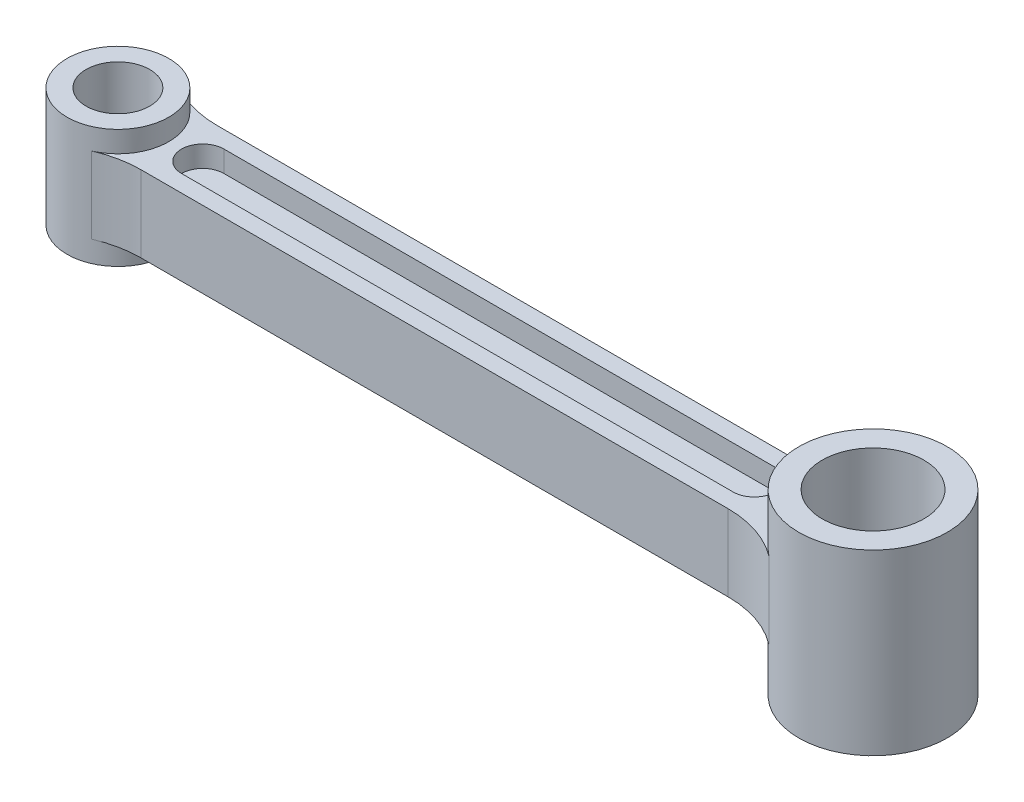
ISO-10303-21;
HEADER;
FILE_DESCRIPTION(('STEP AP214'),'2;1');
FILE_NAME('part.step','',(''),(''),'','','');
FILE_SCHEMA(('AUTOMOTIVE_DESIGN { 1 0 10303 214 1 1 1 1 }'));
ENDSEC;
DATA;
#1=APPLICATION_CONTEXT('core data for automotive mechanical design processes');
#2=APPLICATION_PROTOCOL_DEFINITION('international standard','automotive_design',2000,#1);
#3=PRODUCT_CONTEXT('',#1,'mechanical');
#4=PRODUCT('Part','Part','',(#3));
#5=PRODUCT_RELATED_PRODUCT_CATEGORY('part','',(#4));
#6=PRODUCT_DEFINITION_FORMATION('','',#4);
#7=PRODUCT_DEFINITION_CONTEXT('part definition',#1,'design');
#8=PRODUCT_DEFINITION('design','',#6,#7);
#9=PRODUCT_DEFINITION_SHAPE('','',#8);
#10=(LENGTH_UNIT() NAMED_UNIT(*) SI_UNIT(.MILLI.,.METRE.));
#11=(NAMED_UNIT(*) PLANE_ANGLE_UNIT() SI_UNIT($,.RADIAN.));
#12=(NAMED_UNIT(*) SI_UNIT($,.STERADIAN.) SOLID_ANGLE_UNIT());
#13=UNCERTAINTY_MEASURE_WITH_UNIT(LENGTH_MEASURE(1.E-05),#10,'distance_accuracy_value','');
#14=(GEOMETRIC_REPRESENTATION_CONTEXT(3) GLOBAL_UNCERTAINTY_ASSIGNED_CONTEXT((#13)) GLOBAL_UNIT_ASSIGNED_CONTEXT((#10,
#11,#12)) REPRESENTATION_CONTEXT('',''));
#15=CARTESIAN_POINT('',(0.,0.,0.));
#16=DIRECTION('',(0.,0.,1.));
#17=DIRECTION('',(1.,0.,0.));
#18=AXIS2_PLACEMENT_3D('',#15,#16,#17);
#19=CARTESIAN_POINT('',(-161.06840889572,-9.,0.));
#20=DIRECTION('',(0.,1.,0.));
#21=DIRECTION('',(0.,0.,1.));
#22=AXIS2_PLACEMENT_3D('',#19,#20,#21);
#23=PLANE('',#22);
#24=CARTESIAN_POINT('',(-89.,-9.,0.));
#25=DIRECTION('',(0.,1.,0.));
#26=DIRECTION('',(0.,0.,1.));
#27=AXIS2_PLACEMENT_3D('',#24,#25,#26);
#28=CIRCLE('',#27,12.);
#29=CARTESIAN_POINT('',(-84.2041684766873,-9.,11.));
#30=VERTEX_POINT('',#29);
#31=CARTESIAN_POINT('',(-84.2041684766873,-9.,-11.));
#32=VERTEX_POINT('',#31);
#33=EDGE_CURVE('E235',#30,#32,#28,.T.);
#34=ORIENTED_EDGE('',*,*,#33,.T.);
#35=CARTESIAN_POINT('',(-74.6125054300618,-9.,-33.));
#36=DIRECTION('',(0.,1.,0.));
#37=DIRECTION('',(0.,0.,1.));
#38=AXIS2_PLACEMENT_3D('',#35,#36,#37);
#39=CIRCLE('',#38,24.);
#40=CARTESIAN_POINT('',(-74.6125054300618,-9.,-9.));
#41=VERTEX_POINT('',#40);
#42=EDGE_CURVE('E243',#41,#32,#39,.F.);
#43=ORIENTED_EDGE('',*,*,#42,.F.);
#44=DIRECTION('',(1.,0.,0.));
#45=VECTOR('',#44,1.);
#46=CARTESIAN_POINT('',(-161.06840889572,-9.,-9.));
#47=LINE('',#46,#45);
#48=CARTESIAN_POINT('',(63.8355409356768,-9.,-9.));
#49=VERTEX_POINT('',#48);
#50=EDGE_CURVE('E276',#41,#49,#47,.T.);
#51=ORIENTED_EDGE('',*,*,#50,.T.);
#52=CARTESIAN_POINT('',(63.8355409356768,-9.,-33.));
#53=DIRECTION('',(0.,1.,0.));
#54=DIRECTION('',(0.,0.,1.));
#55=AXIS2_PLACEMENT_3D('',#52,#53,#54);
#56=CIRCLE('',#55,24.);
#57=CARTESIAN_POINT('',(78.3884811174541,-9.,-13.9156626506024));
#58=VERTEX_POINT('',#57);
#59=EDGE_CURVE('E274',#49,#58,#56,.T.);
#60=ORIENTED_EDGE('',*,*,#59,.T.);
#61=CARTESIAN_POINT('',(89.,-9.,0.));
#62=DIRECTION('',(0.,1.,0.));
#63=DIRECTION('',(0.,0.,1.));
#64=AXIS2_PLACEMENT_3D('',#61,#62,#63);
#65=CIRCLE('',#64,17.5);
#66=CARTESIAN_POINT('',(78.3884811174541,-9.,13.9156626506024));
#67=VERTEX_POINT('',#66);
#68=EDGE_CURVE('E271',#67,#58,#65,.F.);
#69=ORIENTED_EDGE('',*,*,#68,.F.);
#70=CARTESIAN_POINT('',(63.8355409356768,-9.,33.));
#71=DIRECTION('',(0.,1.,0.));
#72=DIRECTION('',(0.,0.,1.));
#73=AXIS2_PLACEMENT_3D('',#70,#71,#72);
#74=CIRCLE('',#73,24.);
#75=CARTESIAN_POINT('',(63.8355409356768,-9.,9.));
#76=VERTEX_POINT('',#75);
#77=EDGE_CURVE('E269',#76,#67,#74,.F.);
#78=ORIENTED_EDGE('',*,*,#77,.F.);
#79=DIRECTION('',(1.,0.,0.));
#80=VECTOR('',#79,1.);
#81=CARTESIAN_POINT('',(-161.06840889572,-9.,9.));
#82=LINE('',#81,#80);
#83=CARTESIAN_POINT('',(-74.6125054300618,-9.,9.));
#84=VERTEX_POINT('',#83);
#85=EDGE_CURVE('E267',#84,#76,#82,.T.);
#86=ORIENTED_EDGE('',*,*,#85,.F.);
#87=CARTESIAN_POINT('',(-74.6125054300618,-9.,33.));
#88=DIRECTION('',(0.,1.,0.));
#89=DIRECTION('',(0.,0.,1.));
#90=AXIS2_PLACEMENT_3D('',#87,#88,#89);
#91=CIRCLE('',#90,24.);
#92=EDGE_CURVE('E264',#84,#30,#91,.T.);
#93=ORIENTED_EDGE('',*,*,#92,.T.);
#94=EDGE_LOOP('',(#34,#43,#51,#60,#69,#78,#86,#93));
#95=FACE_BOUND('',#94,.T.);
#96=CARTESIAN_POINT('',(-69.,-9.,0.));
#97=DIRECTION('',(0.,1.,0.));
#98=DIRECTION('',(0.,0.,1.));
#99=AXIS2_PLACEMENT_3D('',#96,#97,#98);
#100=CIRCLE('',#99,5.);
#101=CARTESIAN_POINT('',(-69.,-9.,-5.));
#102=VERTEX_POINT('',#101);
#103=CARTESIAN_POINT('',(-69.,-9.,5.));
#104=VERTEX_POINT('',#103);
#105=EDGE_CURVE('E49',#102,#104,#100,.T.);
#106=ORIENTED_EDGE('',*,*,#105,.T.);
#107=DIRECTION('',(1.,0.,0.));
#108=VECTOR('',#107,1.);
#109=CARTESIAN_POINT('',(-69.,-9.,5.));
#110=LINE('',#109,#108);
#111=CARTESIAN_POINT('',(61.,-9.,5.));
#112=VERTEX_POINT('',#111);
#113=EDGE_CURVE('E167',#104,#112,#110,.T.);
#114=ORIENTED_EDGE('',*,*,#113,.T.);
#115=CARTESIAN_POINT('',(61.,-9.,0.));
#116=DIRECTION('',(0.,1.,0.));
#117=DIRECTION('',(0.,0.,1.));
#118=AXIS2_PLACEMENT_3D('',#115,#116,#117);
#119=CIRCLE('',#118,5.);
#120=CARTESIAN_POINT('',(61.,-9.,-5.));
#121=VERTEX_POINT('',#120);
#122=EDGE_CURVE('E170',#112,#121,#119,.T.);
#123=ORIENTED_EDGE('',*,*,#122,.T.);
#124=DIRECTION('',(-1.,0.,0.));
#125=VECTOR('',#124,1.);
#126=CARTESIAN_POINT('',(-69.,-9.,-5.));
#127=LINE('',#126,#125);
#128=EDGE_CURVE('E176',#121,#102,#127,.T.);
#129=ORIENTED_EDGE('',*,*,#128,.T.);
#130=EDGE_LOOP('',(#106,#114,#123,#129));
#131=FACE_BOUND('',#130,.T.);
#132=ADVANCED_FACE('F34',(#95,#131),#23,.F.);
#133=CARTESIAN_POINT('',(-74.6125054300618,9.,33.));
#134=DIRECTION('',(0.,-1.,0.));
#135=DIRECTION('',(0.,0.,-1.));
#136=AXIS2_PLACEMENT_3D('',#133,#134,#135);
#137=CYLINDRICAL_SURFACE('',#136,24.);
#138=ORIENTED_EDGE('',*,*,#92,.F.);
#139=DIRECTION('',(0.,-1.,0.));
#140=VECTOR('',#139,1.);
#141=CARTESIAN_POINT('',(-74.6125054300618,9.,9.));
#142=LINE('',#141,#140);
#143=CARTESIAN_POINT('',(-74.6125054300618,9.,9.));
#144=VERTEX_POINT('',#143);
#145=EDGE_CURVE('E42',#144,#84,#142,.T.);
#146=ORIENTED_EDGE('',*,*,#145,.F.);
#147=CARTESIAN_POINT('',(-74.6125054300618,9.,33.));
#148=DIRECTION('',(0.,1.,0.));
#149=DIRECTION('',(0.,0.,1.));
#150=AXIS2_PLACEMENT_3D('',#147,#148,#149);
#151=CIRCLE('',#150,24.);
#152=CARTESIAN_POINT('',(-84.2041684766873,9.,11.));
#153=VERTEX_POINT('',#152);
#154=EDGE_CURVE('E242',#144,#153,#151,.T.);
#155=ORIENTED_EDGE('',*,*,#154,.T.);
#156=DIRECTION('',(0.,-1.,0.));
#157=VECTOR('',#156,1.);
#158=CARTESIAN_POINT('',(-84.2041684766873,9.,11.));
#159=LINE('',#158,#157);
#160=EDGE_CURVE('E11',#153,#30,#159,.T.);
#161=ORIENTED_EDGE('',*,*,#160,.T.);
#162=EDGE_LOOP('',(#138,#146,#155,#161));
#163=FACE_BOUND('',#162,.T.);
#164=ADVANCED_FACE('F36',(#163),#137,.F.);
#165=CARTESIAN_POINT('',(-161.06840889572,9.,9.));
#166=DIRECTION('',(0.,0.,-1.));
#167=DIRECTION('',(-1.,0.,0.));
#168=AXIS2_PLACEMENT_3D('',#165,#166,#167);
#169=PLANE('',#168);
#170=ORIENTED_EDGE('',*,*,#85,.T.);
#171=DIRECTION('',(0.,-1.,0.));
#172=VECTOR('',#171,1.);
#173=CARTESIAN_POINT('',(63.8355409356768,9.,9.));
#174=LINE('',#173,#172);
#175=CARTESIAN_POINT('',(63.8355409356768,9.,9.));
#176=VERTEX_POINT('',#175);
#177=EDGE_CURVE('E292',#176,#76,#174,.T.);
#178=ORIENTED_EDGE('',*,*,#177,.F.);
#179=DIRECTION('',(1.,0.,0.));
#180=VECTOR('',#179,1.);
#181=CARTESIAN_POINT('',(-161.06840889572,9.,9.));
#182=LINE('',#181,#180);
#183=EDGE_CURVE('E246',#144,#176,#182,.T.);
#184=ORIENTED_EDGE('',*,*,#183,.F.);
#185=ORIENTED_EDGE('',*,*,#145,.T.);
#186=EDGE_LOOP('',(#170,#178,#184,#185));
#187=FACE_BOUND('',#186,.T.);
#188=ADVANCED_FACE('F297',(#187),#169,.F.);
#189=CARTESIAN_POINT('',(63.8355409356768,9.,33.));
#190=DIRECTION('',(0.,-1.,0.));
#191=DIRECTION('',(0.,0.,-1.));
#192=AXIS2_PLACEMENT_3D('',#189,#190,#191);
#193=CYLINDRICAL_SURFACE('',#192,24.);
#194=ORIENTED_EDGE('',*,*,#77,.T.);
#195=DIRECTION('',(0.,-1.,0.));
#196=VECTOR('',#195,1.);
#197=CARTESIAN_POINT('',(78.3884811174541,9.,13.9156626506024));
#198=LINE('',#197,#196);
#199=CARTESIAN_POINT('',(78.3884811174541,9.,13.9156626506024));
#200=VERTEX_POINT('',#199);
#201=EDGE_CURVE('E289',#200,#67,#198,.T.);
#202=ORIENTED_EDGE('',*,*,#201,.F.);
#203=CARTESIAN_POINT('',(63.8355409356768,9.,33.));
#204=DIRECTION('',(0.,1.,0.));
#205=DIRECTION('',(0.,0.,1.));
#206=AXIS2_PLACEMENT_3D('',#203,#204,#205);
#207=CIRCLE('',#206,24.);
#208=EDGE_CURVE('E248',#176,#200,#207,.F.);
#209=ORIENTED_EDGE('',*,*,#208,.F.);
#210=ORIENTED_EDGE('',*,*,#177,.T.);
#211=EDGE_LOOP('',(#194,#202,#209,#210));
#212=FACE_BOUND('',#211,.T.);
#213=ADVANCED_FACE('F333',(#212),#193,.F.);
#214=CARTESIAN_POINT('',(63.8355409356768,9.,-33.));
#215=DIRECTION('',(0.,-1.,0.));
#216=DIRECTION('',(0.,0.,-1.));
#217=AXIS2_PLACEMENT_3D('',#214,#215,#216);
#218=CYLINDRICAL_SURFACE('',#217,24.);
#219=ORIENTED_EDGE('',*,*,#59,.F.);
#220=DIRECTION('',(0.,-1.,0.));
#221=VECTOR('',#220,1.);
#222=CARTESIAN_POINT('',(63.8355409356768,9.,-9.));
#223=LINE('',#222,#221);
#224=CARTESIAN_POINT('',(63.8355409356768,9.,-9.));
#225=VERTEX_POINT('',#224);
#226=EDGE_CURVE('E284',#225,#49,#223,.T.);
#227=ORIENTED_EDGE('',*,*,#226,.F.);
#228=CARTESIAN_POINT('',(63.8355409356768,9.,-33.));
#229=DIRECTION('',(0.,1.,0.));
#230=DIRECTION('',(0.,0.,1.));
#231=AXIS2_PLACEMENT_3D('',#228,#229,#230);
#232=CIRCLE('',#231,24.);
#233=CARTESIAN_POINT('',(78.3884811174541,9.,-13.9156626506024));
#234=VERTEX_POINT('',#233);
#235=EDGE_CURVE('E252',#225,#234,#232,.T.);
#236=ORIENTED_EDGE('',*,*,#235,.T.);
#237=DIRECTION('',(0.,-1.,0.));
#238=VECTOR('',#237,1.);
#239=CARTESIAN_POINT('',(78.3884811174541,9.,-13.9156626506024));
#240=LINE('',#239,#238);
#241=EDGE_CURVE('E286',#234,#58,#240,.T.);
#242=ORIENTED_EDGE('',*,*,#241,.T.);
#243=EDGE_LOOP('',(#219,#227,#236,#242));
#244=FACE_BOUND('',#243,.T.);
#245=ADVANCED_FACE('F324',(#244),#218,.F.);
#246=CARTESIAN_POINT('',(-161.06840889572,9.,-9.));
#247=DIRECTION('',(0.,0.,-1.));
#248=DIRECTION('',(-1.,0.,0.));
#249=AXIS2_PLACEMENT_3D('',#246,#247,#248);
#250=PLANE('',#249);
#251=ORIENTED_EDGE('',*,*,#50,.F.);
#252=DIRECTION('',(0.,-1.,0.));
#253=VECTOR('',#252,1.);
#254=CARTESIAN_POINT('',(-74.6125054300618,9.,-9.));
#255=LINE('',#254,#253);
#256=CARTESIAN_POINT('',(-74.6125054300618,9.,-9.));
#257=VERTEX_POINT('',#256);
#258=EDGE_CURVE('E282',#257,#41,#255,.T.);
#259=ORIENTED_EDGE('',*,*,#258,.F.);
#260=DIRECTION('',(1.,0.,0.));
#261=VECTOR('',#260,1.);
#262=CARTESIAN_POINT('',(-161.06840889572,9.,-9.));
#263=LINE('',#262,#261);
#264=EDGE_CURVE('E255',#257,#225,#263,.T.);
#265=ORIENTED_EDGE('',*,*,#264,.T.);
#266=ORIENTED_EDGE('',*,*,#226,.T.);
#267=EDGE_LOOP('',(#251,#259,#265,#266));
#268=FACE_BOUND('',#267,.T.);
#269=ADVANCED_FACE('F321',(#268),#250,.T.);
#270=CARTESIAN_POINT('',(-74.6125054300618,9.,-33.));
#271=DIRECTION('',(0.,-1.,0.));
#272=DIRECTION('',(0.,0.,-1.));
#273=AXIS2_PLACEMENT_3D('',#270,#271,#272);
#274=CYLINDRICAL_SURFACE('',#273,24.);
#275=ORIENTED_EDGE('',*,*,#42,.T.);
#276=DIRECTION('',(0.,-1.,0.));
#277=VECTOR('',#276,1.);
#278=CARTESIAN_POINT('',(-84.2041684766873,9.,-11.));
#279=LINE('',#278,#277);
#280=CARTESIAN_POINT('',(-84.2041684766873,9.,-11.));
#281=VERTEX_POINT('',#280);
#282=EDGE_CURVE('E261',#281,#32,#279,.T.);
#283=ORIENTED_EDGE('',*,*,#282,.F.);
#284=CARTESIAN_POINT('',(-74.6125054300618,9.,-33.));
#285=DIRECTION('',(0.,1.,0.));
#286=DIRECTION('',(0.,0.,1.));
#287=AXIS2_PLACEMENT_3D('',#284,#285,#286);
#288=CIRCLE('',#287,24.);
#289=EDGE_CURVE('E258',#257,#281,#288,.F.);
#290=ORIENTED_EDGE('',*,*,#289,.F.);
#291=ORIENTED_EDGE('',*,*,#258,.T.);
#292=EDGE_LOOP('',(#275,#283,#290,#291));
#293=FACE_BOUND('',#292,.T.);
#294=ADVANCED_FACE('F317',(#293),#274,.F.);
#295=CARTESIAN_POINT('',(-161.06840889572,9.,0.));
#296=DIRECTION('',(0.,1.,0.));
#297=DIRECTION('',(0.,0.,1.));
#298=AXIS2_PLACEMENT_3D('',#295,#296,#297);
#299=PLANE('',#298);
#300=CARTESIAN_POINT('',(-69.,9.,0.));
#301=DIRECTION('',(0.,1.,0.));
#302=DIRECTION('',(0.,0.,1.));
#303=AXIS2_PLACEMENT_3D('',#300,#301,#302);
#304=CIRCLE('',#303,5.);
#305=CARTESIAN_POINT('',(-69.,9.,-5.));
#306=VERTEX_POINT('',#305);
#307=CARTESIAN_POINT('',(-69.,9.,5.));
#308=VERTEX_POINT('',#307);
#309=EDGE_CURVE('E57',#306,#308,#304,.T.);
#310=ORIENTED_EDGE('',*,*,#309,.F.);
#311=DIRECTION('',(-1.,0.,0.));
#312=VECTOR('',#311,1.);
#313=CARTESIAN_POINT('',(-69.,9.,-5.));
#314=LINE('',#313,#312);
#315=CARTESIAN_POINT('',(61.,9.,-5.));
#316=VERTEX_POINT('',#315);
#317=EDGE_CURVE('E189',#316,#306,#314,.T.);
#318=ORIENTED_EDGE('',*,*,#317,.F.);
#319=CARTESIAN_POINT('',(61.,9.,0.));
#320=DIRECTION('',(0.,1.,0.));
#321=DIRECTION('',(0.,0.,1.));
#322=AXIS2_PLACEMENT_3D('',#319,#320,#321);
#323=CIRCLE('',#322,5.);
#324=CARTESIAN_POINT('',(61.,9.,5.));
#325=VERTEX_POINT('',#324);
#326=EDGE_CURVE('E203',#325,#316,#323,.T.);
#327=ORIENTED_EDGE('',*,*,#326,.F.);
#328=DIRECTION('',(1.,0.,0.));
#329=VECTOR('',#328,1.);
#330=CARTESIAN_POINT('',(-69.,9.,5.));
#331=LINE('',#330,#329);
#332=EDGE_CURVE('E200',#308,#325,#331,.T.);
#333=ORIENTED_EDGE('',*,*,#332,.F.);
#334=EDGE_LOOP('',(#310,#318,#327,#333));
#335=FACE_BOUND('',#334,.T.);
#336=CARTESIAN_POINT('',(-89.,9.,0.));
#337=DIRECTION('',(0.,1.,0.));
#338=DIRECTION('',(0.,0.,1.));
#339=AXIS2_PLACEMENT_3D('',#336,#337,#338);
#340=CIRCLE('',#339,12.);
#341=EDGE_CURVE('E240',#153,#281,#340,.T.);
#342=ORIENTED_EDGE('',*,*,#341,.F.);
#343=ORIENTED_EDGE('',*,*,#154,.F.);
#344=ORIENTED_EDGE('',*,*,#183,.T.);
#345=ORIENTED_EDGE('',*,*,#208,.T.);
#346=CARTESIAN_POINT('',(89.,9.,0.));
#347=DIRECTION('',(0.,1.,0.));
#348=DIRECTION('',(0.,0.,1.));
#349=AXIS2_PLACEMENT_3D('',#346,#347,#348);
#350=CIRCLE('',#349,17.5);
#351=EDGE_CURVE('E250',#200,#234,#350,.F.);
#352=ORIENTED_EDGE('',*,*,#351,.T.);
#353=ORIENTED_EDGE('',*,*,#235,.F.);
#354=ORIENTED_EDGE('',*,*,#264,.F.);
#355=ORIENTED_EDGE('',*,*,#289,.T.);
#356=EDGE_LOOP('',(#342,#343,#344,#345,#352,#353,#354,#355));
#357=FACE_BOUND('',#356,.T.);
#358=ADVANCED_FACE('F311',(#335,#357),#299,.T.);
#359=CARTESIAN_POINT('',(-89.,14.,0.));
#360=DIRECTION('',(0.,-1.,0.));
#361=DIRECTION('',(0.,0.,-1.));
#362=AXIS2_PLACEMENT_3D('',#359,#360,#361);
#363=CYLINDRICAL_SURFACE('',#362,12.);
#364=ORIENTED_EDGE('',*,*,#341,.T.);
#365=ORIENTED_EDGE('',*,*,#282,.T.);
#366=ORIENTED_EDGE('',*,*,#33,.F.);
#367=ORIENTED_EDGE('',*,*,#160,.F.);
#368=EDGE_LOOP('',(#364,#365,#366,#367));
#369=FACE_BOUND('',#368,.T.);
#370=CARTESIAN_POINT('',(-89.,14.,0.));
#371=DIRECTION('',(0.,1.,0.));
#372=DIRECTION('',(0.,0.,1.));
#373=AXIS2_PLACEMENT_3D('',#370,#371,#372);
#374=CIRCLE('',#373,12.);
#375=CARTESIAN_POINT('',(-89.,14.,12.));
#376=VERTEX_POINT('',#375);
#377=EDGE_CURVE('E228',#376,#376,#374,.T.);
#378=ORIENTED_EDGE('',*,*,#377,.F.);
#379=EDGE_LOOP('',(#378));
#380=FACE_BOUND('',#379,.T.);
#381=CARTESIAN_POINT('',(-89.,-14.,0.));
#382=DIRECTION('',(0.,1.,0.));
#383=DIRECTION('',(0.,0.,1.));
#384=AXIS2_PLACEMENT_3D('',#381,#382,#383);
#385=CIRCLE('',#384,12.);
#386=CARTESIAN_POINT('',(-89.,-14.,12.));
#387=VERTEX_POINT('',#386);
#388=EDGE_CURVE('E223',#387,#387,#385,.T.);
#389=ORIENTED_EDGE('',*,*,#388,.T.);
#390=EDGE_LOOP('',(#389));
#391=FACE_BOUND('',#390,.T.);
#392=ADVANCED_FACE('F308',(#369,#380,#391),#363,.T.);
#393=CARTESIAN_POINT('',(-89.,14.,0.));
#394=DIRECTION('',(0.,-1.,0.));
#395=DIRECTION('',(0.,0.,-1.));
#396=AXIS2_PLACEMENT_3D('',#393,#394,#395);
#397=CYLINDRICAL_SURFACE('',#396,7.50000000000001);
#398=CARTESIAN_POINT('',(-89.,14.,0.));
#399=DIRECTION('',(0.,1.,0.));
#400=DIRECTION('',(0.,0.,1.));
#401=AXIS2_PLACEMENT_3D('',#398,#399,#400);
#402=CIRCLE('',#401,7.50000000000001);
#403=CARTESIAN_POINT('',(-89.,14.,7.50000000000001));
#404=VERTEX_POINT('',#403);
#405=EDGE_CURVE('E231',#404,#404,#402,.T.);
#406=ORIENTED_EDGE('',*,*,#405,.T.);
#407=EDGE_LOOP('',(#406));
#408=FACE_BOUND('',#407,.T.);
#409=CARTESIAN_POINT('',(-89.,-14.,0.));
#410=DIRECTION('',(0.,1.,0.));
#411=DIRECTION('',(0.,0.,1.));
#412=AXIS2_PLACEMENT_3D('',#409,#410,#411);
#413=CIRCLE('',#412,7.50000000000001);
#414=CARTESIAN_POINT('',(-89.,-14.,7.50000000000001));
#415=VERTEX_POINT('',#414);
#416=EDGE_CURVE('E232',#415,#415,#413,.T.);
#417=ORIENTED_EDGE('',*,*,#416,.F.);
#418=EDGE_LOOP('',(#417));
#419=FACE_BOUND('',#418,.T.);
#420=ADVANCED_FACE('F376',(#408,#419),#397,.F.);
#421=CARTESIAN_POINT('',(-161.06840889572,14.,0.));
#422=DIRECTION('',(0.,1.,0.));
#423=DIRECTION('',(0.,0.,1.));
#424=AXIS2_PLACEMENT_3D('',#421,#422,#423);
#425=PLANE('',#424);
#426=ORIENTED_EDGE('',*,*,#377,.T.);
#427=EDGE_LOOP('',(#426));
#428=FACE_BOUND('',#427,.T.);
#429=ORIENTED_EDGE('',*,*,#405,.F.);
#430=EDGE_LOOP('',(#429));
#431=FACE_BOUND('',#430,.T.);
#432=ADVANCED_FACE('F382',(#428,#431),#425,.T.);
#433=CARTESIAN_POINT('',(-161.06840889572,-14.,0.));
#434=DIRECTION('',(0.,1.,0.));
#435=DIRECTION('',(0.,0.,1.));
#436=AXIS2_PLACEMENT_3D('',#433,#434,#435);
#437=PLANE('',#436);
#438=ORIENTED_EDGE('',*,*,#388,.F.);
#439=EDGE_LOOP('',(#438));
#440=FACE_BOUND('',#439,.T.);
#441=ORIENTED_EDGE('',*,*,#416,.T.);
#442=EDGE_LOOP('',(#441));
#443=FACE_BOUND('',#442,.T.);
#444=ADVANCED_FACE('F390',(#440,#443),#437,.F.);
#445=CARTESIAN_POINT('',(89.,21.,0.));
#446=DIRECTION('',(0.,-1.,0.));
#447=DIRECTION('',(0.,0.,-1.));
#448=AXIS2_PLACEMENT_3D('',#445,#446,#447);
#449=CYLINDRICAL_SURFACE('',#448,12.);
#450=CARTESIAN_POINT('',(89.,21.,0.));
#451=DIRECTION('',(0.,1.,0.));
#452=DIRECTION('',(0.,0.,1.));
#453=AXIS2_PLACEMENT_3D('',#450,#451,#452);
#454=CIRCLE('',#453,12.);
#455=CARTESIAN_POINT('',(89.,21.,-12.));
#456=VERTEX_POINT('',#455);
#457=EDGE_CURVE('E216',#456,#456,#454,.T.);
#458=CARTESIAN_POINT('',(89.,-21.,0.));
#459=DIRECTION('',(0.,1.,0.));
#460=DIRECTION('',(0.,0.,1.));
#461=AXIS2_PLACEMENT_3D('',#458,#459,#460);
#462=CIRCLE('',#461,12.);
#463=CARTESIAN_POINT('',(89.,-21.,-12.));
#464=VERTEX_POINT('',#463);
#465=EDGE_CURVE('E210',#464,#464,#462,.T.);
#466=CARTESIAN_POINT('',(89.,21.,-12.));
#467=CARTESIAN_POINT('',(89.,20.5625,-12.));
#468=CARTESIAN_POINT('',(89.,20.125,-12.));
#469=CARTESIAN_POINT('',(89.,19.25,-12.));
#470=CARTESIAN_POINT('',(89.,18.8125,-12.));
#471=CARTESIAN_POINT('',(89.,17.9375,-12.));
#472=CARTESIAN_POINT('',(89.,17.5,-12.));
#473=CARTESIAN_POINT('',(89.,16.625,-12.));
#474=CARTESIAN_POINT('',(89.,16.1875,-12.));
#475=CARTESIAN_POINT('',(89.,15.3125,-12.));
#476=CARTESIAN_POINT('',(89.,14.875,-12.));
#477=CARTESIAN_POINT('',(89.,14.,-12.));
#478=CARTESIAN_POINT('',(89.,13.5625,-12.));
#479=CARTESIAN_POINT('',(89.,12.6875,-12.));
#480=CARTESIAN_POINT('',(89.,12.25,-12.));
#481=CARTESIAN_POINT('',(89.,11.375,-12.));
#482=CARTESIAN_POINT('',(89.,10.9375,-12.));
#483=CARTESIAN_POINT('',(89.,10.0625,-12.));
#484=CARTESIAN_POINT('',(89.,9.625,-12.));
#485=CARTESIAN_POINT('',(89.,8.75,-12.));
#486=CARTESIAN_POINT('',(89.,8.3125,-12.));
#487=CARTESIAN_POINT('',(89.,7.4375,-12.));
#488=CARTESIAN_POINT('',(89.,7.,-12.));
#489=CARTESIAN_POINT('',(89.,6.125,-12.));
#490=CARTESIAN_POINT('',(89.,5.6875,-12.));
#491=CARTESIAN_POINT('',(89.,4.8125,-12.));
#492=CARTESIAN_POINT('',(89.,4.375,-12.));
#493=CARTESIAN_POINT('',(89.,3.5,-12.));
#494=CARTESIAN_POINT('',(89.,3.0625,-12.));
#495=CARTESIAN_POINT('',(89.,2.1875,-12.));
#496=CARTESIAN_POINT('',(89.,1.75,-12.));
#497=CARTESIAN_POINT('',(89.,0.874999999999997,-12.));
#498=CARTESIAN_POINT('',(89.,0.437499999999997,-12.));
#499=CARTESIAN_POINT('',(89.,-0.437500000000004,-12.));
#500=CARTESIAN_POINT('',(89.,-0.875000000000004,-12.));
#501=CARTESIAN_POINT('',(89.,-1.75000000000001,-12.));
#502=CARTESIAN_POINT('',(89.,-2.18750000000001,-12.));
#503=CARTESIAN_POINT('',(89.,-3.0625,-12.));
#504=CARTESIAN_POINT('',(89.,-3.5,-12.));
#505=CARTESIAN_POINT('',(89.,-4.375,-12.));
#506=CARTESIAN_POINT('',(89.,-4.8125,-12.));
#507=CARTESIAN_POINT('',(89.,-5.68750000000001,-12.));
#508=CARTESIAN_POINT('',(89.,-6.12500000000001,-12.));
#509=CARTESIAN_POINT('',(89.,-7.00000000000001,-12.));
#510=CARTESIAN_POINT('',(89.,-7.4375,-12.));
#511=CARTESIAN_POINT('',(89.,-8.3125,-12.));
#512=CARTESIAN_POINT('',(89.,-8.75,-12.));
#513=CARTESIAN_POINT('',(89.,-9.625,-12.));
#514=CARTESIAN_POINT('',(89.,-10.0625,-12.));
#515=CARTESIAN_POINT('',(89.,-10.9375,-12.));
#516=CARTESIAN_POINT('',(89.,-11.375,-12.));
#517=CARTESIAN_POINT('',(89.,-12.25,-12.));
#518=CARTESIAN_POINT('',(89.,-12.6875,-12.));
#519=CARTESIAN_POINT('',(89.,-13.5625,-12.));
#520=CARTESIAN_POINT('',(89.,-14.,-12.));
#521=CARTESIAN_POINT('',(89.,-14.875,-12.));
#522=CARTESIAN_POINT('',(89.,-15.3125,-12.));
#523=CARTESIAN_POINT('',(89.,-16.1875,-12.));
#524=CARTESIAN_POINT('',(89.,-16.625,-12.));
#525=CARTESIAN_POINT('',(89.,-17.5,-12.));
#526=CARTESIAN_POINT('',(89.,-17.9375,-12.));
#527=CARTESIAN_POINT('',(89.,-18.8125,-12.));
#528=CARTESIAN_POINT('',(89.,-19.25,-12.));
#529=CARTESIAN_POINT('',(89.,-20.125,-12.));
#530=CARTESIAN_POINT('',(89.,-20.5625,-12.));
#531=CARTESIAN_POINT('',(89.,-21.,-12.));
#532=B_SPLINE_CURVE_WITH_KNOTS('',3,(#466,#467,#468,#469,#470,#471,#472,#473,#474,#475,#476,
#477,#478,#479,#480,#481,#482,#483,#484,#485,#486,#487,#488,#489,#490,#491,#492,#493,#494,#495,
#496,#497,#498,#499,#500,#501,#502,#503,#504,#505,#506,#507,#508,#509,#510,#511,#512,#513,#514,
#515,#516,#517,#518,#519,#520,#521,#522,#523,#524,#525,#526,#527,#528,#529,#530,#531),
.UNSPECIFIED.,.F.,.F.,(4,2,2,2,2,2,2,2,2,2,2,2,2,2,2,2,2,2,2,2,2,2,2,2,2,2,2,2,2,2,2,2,4),(0.,
1.3125,2.625,3.9375,5.25,6.5625,7.875,9.1875,10.5,11.8125,13.125,14.4375,15.75,17.0625,18.375,
19.6875,21.,22.3125,23.625,24.9375,26.25,27.5625,28.875,30.1875,31.5,32.8125,34.125,35.4375,
36.75,38.0625,39.375,40.6875,42.),.UNSPECIFIED.);
#533=EDGE_CURVE('BSEAM398',#456,#464,#532,.T.);
#534=ORIENTED_EDGE('',*,*,#457,.T.);
#535=ORIENTED_EDGE('',*,*,#465,.F.);
#536=ORIENTED_EDGE('',*,*,#533,.T.);
#537=ORIENTED_EDGE('',*,*,#533,.F.);
#538=EDGE_LOOP('',(#534,#536,#535,#537));
#539=FACE_BOUND('',#538,.T.);
#540=ADVANCED_FACE('F398',(#539),#449,.F.);
#541=CARTESIAN_POINT('',(89.,21.,0.));
#542=DIRECTION('',(0.,-1.,0.));
#543=DIRECTION('',(0.,0.,-1.));
#544=AXIS2_PLACEMENT_3D('',#541,#542,#543);
#545=CYLINDRICAL_SURFACE('',#544,17.5);
#546=ORIENTED_EDGE('',*,*,#241,.F.);
#547=ORIENTED_EDGE('',*,*,#351,.F.);
#548=ORIENTED_EDGE('',*,*,#201,.T.);
#549=ORIENTED_EDGE('',*,*,#68,.T.);
#550=EDGE_LOOP('',(#546,#547,#548,#549));
#551=FACE_BOUND('',#550,.T.);
#552=CARTESIAN_POINT('',(89.,21.,0.));
#553=DIRECTION('',(0.,1.,0.));
#554=DIRECTION('',(0.,0.,1.));
#555=AXIS2_PLACEMENT_3D('',#552,#553,#554);
#556=CIRCLE('',#555,17.5);
#557=CARTESIAN_POINT('',(89.,21.,17.5));
#558=VERTEX_POINT('',#557);
#559=EDGE_CURVE('E219',#558,#558,#556,.F.);
#560=ORIENTED_EDGE('',*,*,#559,.T.);
#561=EDGE_LOOP('',(#560));
#562=FACE_BOUND('',#561,.T.);
#563=CARTESIAN_POINT('',(89.,-21.,0.));
#564=DIRECTION('',(0.,1.,0.));
#565=DIRECTION('',(0.,0.,1.));
#566=AXIS2_PLACEMENT_3D('',#563,#564,#565);
#567=CIRCLE('',#566,17.5);
#568=CARTESIAN_POINT('',(89.,-21.,17.5));
#569=VERTEX_POINT('',#568);
#570=EDGE_CURVE('E220',#569,#569,#567,.F.);
#571=ORIENTED_EDGE('',*,*,#570,.F.);
#572=EDGE_LOOP('',(#571));
#573=FACE_BOUND('',#572,.T.);
#574=ADVANCED_FACE('F329',(#551,#562,#573),#545,.T.);
#575=CARTESIAN_POINT('',(-161.06840889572,21.,0.));
#576=DIRECTION('',(0.,1.,0.));
#577=DIRECTION('',(0.,0.,1.));
#578=AXIS2_PLACEMENT_3D('',#575,#576,#577);
#579=PLANE('',#578);
#580=ORIENTED_EDGE('',*,*,#457,.F.);
#581=EDGE_LOOP('',(#580));
#582=FACE_BOUND('',#581,.T.);
#583=ORIENTED_EDGE('',*,*,#559,.F.);
#584=EDGE_LOOP('',(#583));
#585=FACE_BOUND('',#584,.T.);
#586=ADVANCED_FACE('F413',(#582,#585),#579,.T.);
#587=CARTESIAN_POINT('',(-161.06840889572,-21.,0.));
#588=DIRECTION('',(0.,1.,0.));
#589=DIRECTION('',(0.,0.,1.));
#590=AXIS2_PLACEMENT_3D('',#587,#588,#589);
#591=PLANE('',#590);
#592=ORIENTED_EDGE('',*,*,#465,.T.);
#593=EDGE_LOOP('',(#592));
#594=FACE_BOUND('',#593,.T.);
#595=ORIENTED_EDGE('',*,*,#570,.T.);
#596=EDGE_LOOP('',(#595));
#597=FACE_BOUND('',#596,.T.);
#598=ADVANCED_FACE('F420',(#594,#597),#591,.F.);
#599=CARTESIAN_POINT('',(-69.,4.,0.));
#600=DIRECTION('',(0.,1.,0.));
#601=DIRECTION('',(0.,0.,1.));
#602=AXIS2_PLACEMENT_3D('',#599,#600,#601);
#603=CYLINDRICAL_SURFACE('',#602,5.);
#604=ORIENTED_EDGE('',*,*,#309,.T.);
#605=DIRECTION('',(0.,1.,0.));
#606=VECTOR('',#605,1.);
#607=CARTESIAN_POINT('',(-69.,4.,5.));
#608=LINE('',#607,#606);
#609=CARTESIAN_POINT('',(-69.,4.,5.));
#610=VERTEX_POINT('',#609);
#611=EDGE_CURVE('E198',#610,#308,#608,.T.);
#612=ORIENTED_EDGE('',*,*,#611,.F.);
#613=CARTESIAN_POINT('',(-69.,4.,0.));
#614=DIRECTION('',(0.,1.,0.));
#615=DIRECTION('',(0.,0.,1.));
#616=AXIS2_PLACEMENT_3D('',#613,#614,#615);
#617=CIRCLE('',#616,5.);
#618=CARTESIAN_POINT('',(-69.,4.,-5.));
#619=VERTEX_POINT('',#618);
#620=EDGE_CURVE('E185',#619,#610,#617,.T.);
#621=ORIENTED_EDGE('',*,*,#620,.F.);
#622=DIRECTION('',(0.,1.,0.));
#623=VECTOR('',#622,1.);
#624=CARTESIAN_POINT('',(-69.,4.,-5.));
#625=LINE('',#624,#623);
#626=EDGE_CURVE('E208',#619,#306,#625,.T.);
#627=ORIENTED_EDGE('',*,*,#626,.T.);
#628=EDGE_LOOP('',(#604,#612,#621,#627));
#629=FACE_BOUND('',#628,.T.);
#630=ADVANCED_FACE('F427',(#629),#603,.F.);
#631=CARTESIAN_POINT('',(-69.,4.,-5.));
#632=DIRECTION('',(0.,0.,-1.));
#633=DIRECTION('',(-1.,0.,0.));
#634=AXIS2_PLACEMENT_3D('',#631,#632,#633);
#635=PLANE('',#634);
#636=ORIENTED_EDGE('',*,*,#317,.T.);
#637=ORIENTED_EDGE('',*,*,#626,.F.);
#638=DIRECTION('',(-1.,0.,0.));
#639=VECTOR('',#638,1.);
#640=CARTESIAN_POINT('',(-69.,4.,-5.));
#641=LINE('',#640,#639);
#642=CARTESIAN_POINT('',(61.,4.,-5.));
#643=VERTEX_POINT('',#642);
#644=EDGE_CURVE('E195',#643,#619,#641,.T.);
#645=ORIENTED_EDGE('',*,*,#644,.F.);
#646=DIRECTION('',(0.,1.,0.));
#647=VECTOR('',#646,1.);
#648=CARTESIAN_POINT('',(61.,4.,-5.));
#649=LINE('',#648,#647);
#650=EDGE_CURVE('E211',#643,#316,#649,.T.);
#651=ORIENTED_EDGE('',*,*,#650,.T.);
#652=EDGE_LOOP('',(#636,#637,#645,#651));
#653=FACE_BOUND('',#652,.T.);
#654=ADVANCED_FACE('F434',(#653),#635,.F.);
#655=CARTESIAN_POINT('',(61.,4.,0.));
#656=DIRECTION('',(0.,1.,0.));
#657=DIRECTION('',(0.,0.,1.));
#658=AXIS2_PLACEMENT_3D('',#655,#656,#657);
#659=CYLINDRICAL_SURFACE('',#658,5.);
#660=ORIENTED_EDGE('',*,*,#326,.T.);
#661=ORIENTED_EDGE('',*,*,#650,.F.);
#662=CARTESIAN_POINT('',(61.,4.,0.));
#663=DIRECTION('',(0.,1.,0.));
#664=DIRECTION('',(0.,0.,1.));
#665=AXIS2_PLACEMENT_3D('',#662,#663,#664);
#666=CIRCLE('',#665,5.);
#667=CARTESIAN_POINT('',(61.,4.,5.));
#668=VERTEX_POINT('',#667);
#669=EDGE_CURVE('E192',#668,#643,#666,.T.);
#670=ORIENTED_EDGE('',*,*,#669,.F.);
#671=DIRECTION('',(0.,1.,0.));
#672=VECTOR('',#671,1.);
#673=CARTESIAN_POINT('',(61.,4.,5.));
#674=LINE('',#673,#672);
#675=EDGE_CURVE('E213',#668,#325,#674,.T.);
#676=ORIENTED_EDGE('',*,*,#675,.T.);
#677=EDGE_LOOP('',(#660,#661,#670,#676));
#678=FACE_BOUND('',#677,.T.);
#679=ADVANCED_FACE('F441',(#678),#659,.F.);
#680=CARTESIAN_POINT('',(-69.,4.,5.));
#681=DIRECTION('',(0.,0.,1.));
#682=DIRECTION('',(1.,0.,0.));
#683=AXIS2_PLACEMENT_3D('',#680,#681,#682);
#684=PLANE('',#683);
#685=ORIENTED_EDGE('',*,*,#332,.T.);
#686=ORIENTED_EDGE('',*,*,#675,.F.);
#687=DIRECTION('',(1.,0.,0.));
#688=VECTOR('',#687,1.);
#689=CARTESIAN_POINT('',(-69.,4.,5.));
#690=LINE('',#689,#688);
#691=EDGE_CURVE('E188',#610,#668,#690,.T.);
#692=ORIENTED_EDGE('',*,*,#691,.F.);
#693=ORIENTED_EDGE('',*,*,#611,.T.);
#694=EDGE_LOOP('',(#685,#686,#692,#693));
#695=FACE_BOUND('',#694,.T.);
#696=ADVANCED_FACE('F449',(#695),#684,.F.);
#697=CARTESIAN_POINT('',(-69.,4.,0.));
#698=DIRECTION('',(0.,1.,0.));
#699=DIRECTION('',(0.,0.,1.));
#700=AXIS2_PLACEMENT_3D('',#697,#698,#699);
#701=PLANE('',#700);
#702=ORIENTED_EDGE('',*,*,#620,.T.);
#703=ORIENTED_EDGE('',*,*,#691,.T.);
#704=ORIENTED_EDGE('',*,*,#669,.T.);
#705=ORIENTED_EDGE('',*,*,#644,.T.);
#706=EDGE_LOOP('',(#702,#703,#704,#705));
#707=FACE_BOUND('',#706,.T.);
#708=ADVANCED_FACE('F457',(#707),#701,.T.);
#709=CARTESIAN_POINT('',(-69.,-4.,0.));
#710=DIRECTION('',(0.,-1.,0.));
#711=DIRECTION('',(0.,0.,-1.));
#712=AXIS2_PLACEMENT_3D('',#709,#710,#711);
#713=CYLINDRICAL_SURFACE('',#712,5.);
#714=ORIENTED_EDGE('',*,*,#105,.F.);
#715=DIRECTION('',(0.,-1.,0.));
#716=VECTOR('',#715,1.);
#717=CARTESIAN_POINT('',(-69.,-4.,-5.));
#718=LINE('',#717,#716);
#719=CARTESIAN_POINT('',(-69.,-4.,-5.));
#720=VERTEX_POINT('',#719);
#721=EDGE_CURVE('E152',#720,#102,#718,.T.);
#722=ORIENTED_EDGE('',*,*,#721,.F.);
#723=CARTESIAN_POINT('',(-69.,-4.,0.));
#724=DIRECTION('',(0.,1.,0.));
#725=DIRECTION('',(0.,0.,1.));
#726=AXIS2_PLACEMENT_3D('',#723,#724,#725);
#727=CIRCLE('',#726,5.);
#728=CARTESIAN_POINT('',(-69.,-4.,5.));
#729=VERTEX_POINT('',#728);
#730=EDGE_CURVE('E159',#720,#729,#727,.T.);
#731=ORIENTED_EDGE('',*,*,#730,.T.);
#732=DIRECTION('',(0.,-1.,0.));
#733=VECTOR('',#732,1.);
#734=CARTESIAN_POINT('',(-69.,-4.,5.));
#735=LINE('',#734,#733);
#736=EDGE_CURVE('E180',#729,#104,#735,.T.);
#737=ORIENTED_EDGE('',*,*,#736,.T.);
#738=EDGE_LOOP('',(#714,#722,#731,#737));
#739=FACE_BOUND('',#738,.T.);
#740=ADVANCED_FACE('F162',(#739),#713,.F.);
#741=CARTESIAN_POINT('',(-69.,-4.,5.));
#742=DIRECTION('',(0.,0.,-1.));
#743=DIRECTION('',(-1.,0.,0.));
#744=AXIS2_PLACEMENT_3D('',#741,#742,#743);
#745=PLANE('',#744);
#746=ORIENTED_EDGE('',*,*,#113,.F.);
#747=ORIENTED_EDGE('',*,*,#736,.F.);
#748=DIRECTION('',(1.,0.,0.));
#749=VECTOR('',#748,1.);
#750=CARTESIAN_POINT('',(-69.,-4.,5.));
#751=LINE('',#750,#749);
#752=CARTESIAN_POINT('',(61.,-4.,5.));
#753=VERTEX_POINT('',#752);
#754=EDGE_CURVE('E164',#729,#753,#751,.T.);
#755=ORIENTED_EDGE('',*,*,#754,.T.);
#756=DIRECTION('',(0.,-1.,0.));
#757=VECTOR('',#756,1.);
#758=CARTESIAN_POINT('',(61.,-4.,5.));
#759=LINE('',#758,#757);
#760=EDGE_CURVE('E182',#753,#112,#759,.T.);
#761=ORIENTED_EDGE('',*,*,#760,.T.);
#762=EDGE_LOOP('',(#746,#747,#755,#761));
#763=FACE_BOUND('',#762,.T.);
#764=ADVANCED_FACE('F472',(#763),#745,.T.);
#765=CARTESIAN_POINT('',(61.,-4.,0.));
#766=DIRECTION('',(0.,-1.,0.));
#767=DIRECTION('',(0.,0.,-1.));
#768=AXIS2_PLACEMENT_3D('',#765,#766,#767);
#769=CYLINDRICAL_SURFACE('',#768,5.);
#770=ORIENTED_EDGE('',*,*,#122,.F.);
#771=ORIENTED_EDGE('',*,*,#760,.F.);
#772=CARTESIAN_POINT('',(61.,-4.,0.));
#773=DIRECTION('',(0.,1.,0.));
#774=DIRECTION('',(0.,0.,1.));
#775=AXIS2_PLACEMENT_3D('',#772,#773,#774);
#776=CIRCLE('',#775,5.);
#777=CARTESIAN_POINT('',(61.,-4.,-5.));
#778=VERTEX_POINT('',#777);
#779=EDGE_CURVE('E158',#753,#778,#776,.T.);
#780=ORIENTED_EDGE('',*,*,#779,.T.);
#781=DIRECTION('',(0.,-1.,0.));
#782=VECTOR('',#781,1.);
#783=CARTESIAN_POINT('',(61.,-4.,-5.));
#784=LINE('',#783,#782);
#785=EDGE_CURVE('E154',#778,#121,#784,.T.);
#786=ORIENTED_EDGE('',*,*,#785,.T.);
#787=EDGE_LOOP('',(#770,#771,#780,#786));
#788=FACE_BOUND('',#787,.T.);
#789=ADVANCED_FACE('F479',(#788),#769,.F.);
#790=CARTESIAN_POINT('',(-69.,-4.,-5.));
#791=DIRECTION('',(0.,0.,1.));
#792=DIRECTION('',(1.,0.,0.));
#793=AXIS2_PLACEMENT_3D('',#790,#791,#792);
#794=PLANE('',#793);
#795=ORIENTED_EDGE('',*,*,#128,.F.);
#796=ORIENTED_EDGE('',*,*,#785,.F.);
#797=DIRECTION('',(-1.,0.,0.));
#798=VECTOR('',#797,1.);
#799=CARTESIAN_POINT('',(-69.,-4.,-5.));
#800=LINE('',#799,#798);
#801=EDGE_CURVE('E149',#778,#720,#800,.T.);
#802=ORIENTED_EDGE('',*,*,#801,.T.);
#803=ORIENTED_EDGE('',*,*,#721,.T.);
#804=EDGE_LOOP('',(#795,#796,#802,#803));
#805=FACE_BOUND('',#804,.T.);
#806=ADVANCED_FACE('F151',(#805),#794,.T.);
#807=CARTESIAN_POINT('',(-69.,-4.,0.));
#808=DIRECTION('',(0.,-1.,0.));
#809=DIRECTION('',(0.,0.,1.));
#810=AXIS2_PLACEMENT_3D('',#807,#808,#809);
#811=PLANE('',#810);
#812=ORIENTED_EDGE('',*,*,#730,.F.);
#813=ORIENTED_EDGE('',*,*,#801,.F.);
#814=ORIENTED_EDGE('',*,*,#779,.F.);
#815=ORIENTED_EDGE('',*,*,#754,.F.);
#816=EDGE_LOOP('',(#812,#813,#814,#815));
#817=FACE_BOUND('',#816,.T.);
#818=ADVANCED_FACE('F166',(#817),#811,.T.);
#819=CLOSED_SHELL('',(#132,#164,#188,#213,#245,#269,#294,#358,#392,#420,#432,#444,#540,#574,
#586,#598,#630,#654,#679,#696,#708,#740,#764,#789,#806,#818));
#820=MANIFOLD_SOLID_BREP('B2',#819);
#821=ADVANCED_BREP_SHAPE_REPRESENTATION('',(#18,#820),#14);
#822=SHAPE_DEFINITION_REPRESENTATION(#9,#821);
ENDSEC;
END-ISO-10303-21;
